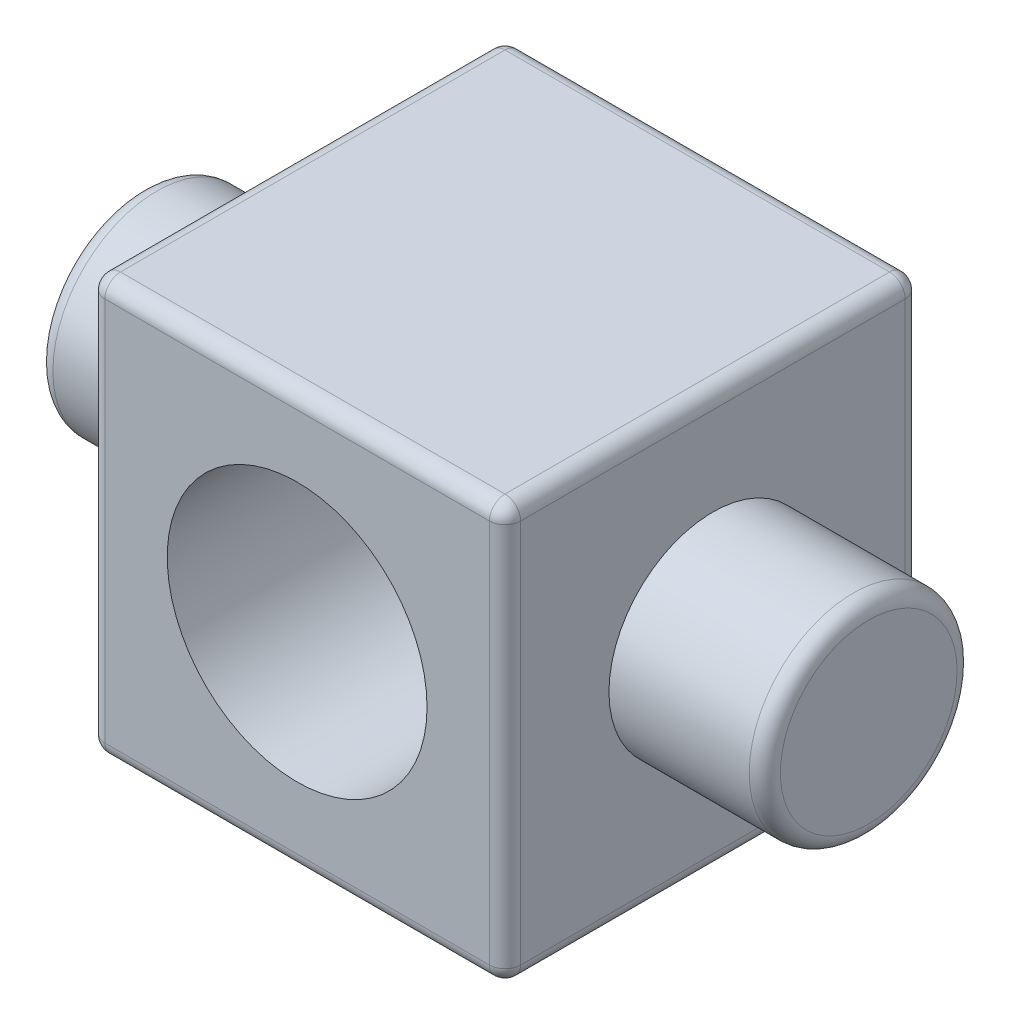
ISO-10303-21;
HEADER;
FILE_DESCRIPTION(('STEP AP214'),'2;1');
FILE_NAME('part.step','',(''),(''),'','','');
FILE_SCHEMA(('AUTOMOTIVE_DESIGN { 1 0 10303 214 1 1 1 1 }'));
ENDSEC;
DATA;
#1=APPLICATION_CONTEXT('core data for automotive mechanical design processes');
#2=APPLICATION_PROTOCOL_DEFINITION('international standard','automotive_design',2000,#1);
#3=PRODUCT_CONTEXT('',#1,'mechanical');
#4=PRODUCT('Part','Part','',(#3));
#5=PRODUCT_RELATED_PRODUCT_CATEGORY('part','',(#4));
#6=PRODUCT_DEFINITION_FORMATION('','',#4);
#7=PRODUCT_DEFINITION_CONTEXT('part definition',#1,'design');
#8=PRODUCT_DEFINITION('design','',#6,#7);
#9=PRODUCT_DEFINITION_SHAPE('','',#8);
#10=(LENGTH_UNIT() NAMED_UNIT(*) SI_UNIT(.MILLI.,.METRE.));
#11=(NAMED_UNIT(*) PLANE_ANGLE_UNIT() SI_UNIT($,.RADIAN.));
#12=(NAMED_UNIT(*) SI_UNIT($,.STERADIAN.) SOLID_ANGLE_UNIT());
#13=UNCERTAINTY_MEASURE_WITH_UNIT(LENGTH_MEASURE(1.E-05),#10,'distance_accuracy_value','');
#14=(GEOMETRIC_REPRESENTATION_CONTEXT(3) GLOBAL_UNCERTAINTY_ASSIGNED_CONTEXT((#13)) GLOBAL_UNIT_ASSIGNED_CONTEXT((#10,
#11,#12)) REPRESENTATION_CONTEXT('',''));
#15=CARTESIAN_POINT('',(0.,0.,0.));
#16=DIRECTION('',(0.,0.,1.));
#17=DIRECTION('',(1.,0.,0.));
#18=AXIS2_PLACEMENT_3D('',#15,#16,#17);
#19=CARTESIAN_POINT('',(0.,0.,80.));
#20=DIRECTION('',(0.,0.,-1.));
#21=DIRECTION('',(-1.,0.,0.));
#22=AXIS2_PLACEMENT_3D('',#19,#20,#21);
#23=PLANE('',#22);
#24=DIRECTION('',(0.,-1.,0.));
#25=VECTOR('',#24,1.);
#26=CARTESIAN_POINT('',(3.,0.,80.));
#27=LINE('',#26,#25);
#28=CARTESIAN_POINT('',(3.,77.,80.));
#29=VERTEX_POINT('',#28);
#30=CARTESIAN_POINT('',(3.,3.,80.));
#31=VERTEX_POINT('',#30);
#32=EDGE_CURVE('E189',#29,#31,#27,.T.);
#33=ORIENTED_EDGE('',*,*,#32,.T.);
#34=DIRECTION('',(1.,0.,0.));
#35=VECTOR('',#34,1.);
#36=CARTESIAN_POINT('',(0.,3.,80.));
#37=LINE('',#36,#35);
#38=CARTESIAN_POINT('',(77.,3.,80.));
#39=VERTEX_POINT('',#38);
#40=EDGE_CURVE('E191',#31,#39,#37,.T.);
#41=ORIENTED_EDGE('',*,*,#40,.T.);
#42=DIRECTION('',(0.,1.,0.));
#43=VECTOR('',#42,1.);
#44=CARTESIAN_POINT('',(77.,0.,80.));
#45=LINE('',#44,#43);
#46=CARTESIAN_POINT('',(77.,77.,80.));
#47=VERTEX_POINT('',#46);
#48=EDGE_CURVE('E185',#39,#47,#45,.T.);
#49=ORIENTED_EDGE('',*,*,#48,.T.);
#50=DIRECTION('',(-1.,0.,0.));
#51=VECTOR('',#50,1.);
#52=CARTESIAN_POINT('',(0.,77.,80.));
#53=LINE('',#52,#51);
#54=EDGE_CURVE('E187',#47,#29,#53,.T.);
#55=ORIENTED_EDGE('',*,*,#54,.T.);
#56=EDGE_LOOP('',(#33,#41,#49,#55));
#57=FACE_BOUND('',#56,.T.);
#58=CARTESIAN_POINT('',(40.,40.,80.));
#59=DIRECTION('',(0.,0.,1.));
#60=DIRECTION('',(1.,0.,0.));
#61=AXIS2_PLACEMENT_3D('',#58,#59,#60);
#62=CIRCLE('',#61,25.);
#63=CARTESIAN_POINT('',(65.,40.,80.));
#64=VERTEX_POINT('',#63);
#65=EDGE_CURVE('E270',#64,#64,#62,.T.);
#66=ORIENTED_EDGE('',*,*,#65,.F.);
#67=EDGE_LOOP('',(#66));
#68=FACE_BOUND('',#67,.T.);
#69=ADVANCED_FACE('F33',(#57,#68),#23,.F.);
#70=CARTESIAN_POINT('',(0.,0.,0.));
#71=DIRECTION('',(0.,0.,-1.));
#72=DIRECTION('',(-1.,0.,0.));
#73=AXIS2_PLACEMENT_3D('',#70,#71,#72);
#74=PLANE('',#73);
#75=DIRECTION('',(1.,0.,0.));
#76=VECTOR('',#75,1.);
#77=CARTESIAN_POINT('',(0.,3.,0.));
#78=LINE('',#77,#76);
#79=CARTESIAN_POINT('',(77.,3.,0.));
#80=VERTEX_POINT('',#79);
#81=CARTESIAN_POINT('',(3.,3.,0.));
#82=VERTEX_POINT('',#81);
#83=EDGE_CURVE('E42',#80,#82,#78,.F.);
#84=ORIENTED_EDGE('',*,*,#83,.T.);
#85=DIRECTION('',(0.,-1.,0.));
#86=VECTOR('',#85,1.);
#87=CARTESIAN_POINT('',(3.,80.,0.));
#88=LINE('',#87,#86);
#89=CARTESIAN_POINT('',(3.,77.,0.));
#90=VERTEX_POINT('',#89);
#91=EDGE_CURVE('E11',#82,#90,#88,.F.);
#92=ORIENTED_EDGE('',*,*,#91,.T.);
#93=DIRECTION('',(-1.,0.,0.));
#94=VECTOR('',#93,1.);
#95=CARTESIAN_POINT('',(80.,77.,0.));
#96=LINE('',#95,#94);
#97=CARTESIAN_POINT('',(77.,77.,0.));
#98=VERTEX_POINT('',#97);
#99=EDGE_CURVE('E203',#90,#98,#96,.F.);
#100=ORIENTED_EDGE('',*,*,#99,.T.);
#101=DIRECTION('',(0.,1.,0.));
#102=VECTOR('',#101,1.);
#103=CARTESIAN_POINT('',(77.,0.,0.));
#104=LINE('',#103,#102);
#105=EDGE_CURVE('E53',#98,#80,#104,.F.);
#106=ORIENTED_EDGE('',*,*,#105,.T.);
#107=EDGE_LOOP('',(#84,#92,#100,#106));
#108=FACE_BOUND('',#107,.T.);
#109=CARTESIAN_POINT('',(40.,40.,0.));
#110=DIRECTION('',(0.,0.,1.));
#111=DIRECTION('',(1.,0.,0.));
#112=AXIS2_PLACEMENT_3D('',#109,#110,#111);
#113=CIRCLE('',#112,25.);
#114=CARTESIAN_POINT('',(65.,40.,0.));
#115=VERTEX_POINT('',#114);
#116=EDGE_CURVE('E263',#115,#115,#113,.T.);
#117=ORIENTED_EDGE('',*,*,#116,.T.);
#118=EDGE_LOOP('',(#117));
#119=FACE_BOUND('',#118,.T.);
#120=ADVANCED_FACE('F308',(#108,#119),#74,.T.);
#121=CARTESIAN_POINT('',(0.,0.,80.));
#122=DIRECTION('',(1.,0.,0.));
#123=DIRECTION('',(0.,0.,-1.));
#124=AXIS2_PLACEMENT_3D('',#121,#122,#123);
#125=PLANE('',#124);
#126=DIRECTION('',(0.,0.,-1.));
#127=VECTOR('',#126,1.);
#128=CARTESIAN_POINT('',(0.,3.,80.));
#129=LINE('',#128,#127);
#130=CARTESIAN_POINT('',(0.,3.,3.));
#131=VERTEX_POINT('',#130);
#132=CARTESIAN_POINT('',(0.,3.,77.));
#133=VERTEX_POINT('',#132);
#134=EDGE_CURVE('E151',#131,#133,#129,.F.);
#135=ORIENTED_EDGE('',*,*,#134,.T.);
#136=DIRECTION('',(0.,-1.,0.));
#137=VECTOR('',#136,1.);
#138=CARTESIAN_POINT('',(0.,0.,77.));
#139=LINE('',#138,#137);
#140=CARTESIAN_POINT('',(0.,77.,77.));
#141=VERTEX_POINT('',#140);
#142=EDGE_CURVE('E157',#133,#141,#139,.F.);
#143=ORIENTED_EDGE('',*,*,#142,.T.);
#144=DIRECTION('',(0.,0.,-1.));
#145=VECTOR('',#144,1.);
#146=CARTESIAN_POINT('',(0.,77.,80.));
#147=LINE('',#146,#145);
#148=CARTESIAN_POINT('',(0.,77.,3.));
#149=VERTEX_POINT('',#148);
#150=EDGE_CURVE('E127',#141,#149,#147,.T.);
#151=ORIENTED_EDGE('',*,*,#150,.T.);
#152=DIRECTION('',(0.,-1.,0.));
#153=VECTOR('',#152,1.);
#154=CARTESIAN_POINT('',(0.,0.,3.));
#155=LINE('',#154,#153);
#156=EDGE_CURVE('E145',#149,#131,#155,.T.);
#157=ORIENTED_EDGE('',*,*,#156,.T.);
#158=EDGE_LOOP('',(#135,#143,#151,#157));
#159=FACE_BOUND('',#158,.T.);
#160=CARTESIAN_POINT('',(0.,40.,40.));
#161=DIRECTION('',(1.,0.,0.));
#162=DIRECTION('',(0.,0.,-1.));
#163=AXIS2_PLACEMENT_3D('',#160,#161,#162);
#164=CIRCLE('',#163,20.);
#165=CARTESIAN_POINT('',(0.,40.,20.));
#166=VERTEX_POINT('',#165);
#167=EDGE_CURVE('E280',#166,#166,#164,.F.);
#168=ORIENTED_EDGE('',*,*,#167,.F.);
#169=EDGE_LOOP('',(#168));
#170=FACE_BOUND('',#169,.T.);
#171=ADVANCED_FACE('F154',(#159,#170),#125,.F.);
#172=CARTESIAN_POINT('',(0.,0.,80.));
#173=DIRECTION('',(0.,1.,0.));
#174=DIRECTION('',(0.,0.,1.));
#175=AXIS2_PLACEMENT_3D('',#172,#173,#174);
#176=PLANE('',#175);
#177=DIRECTION('',(1.,0.,0.));
#178=VECTOR('',#177,1.);
#179=CARTESIAN_POINT('',(0.,0.,77.));
#180=LINE('',#179,#178);
#181=CARTESIAN_POINT('',(77.,0.,77.));
#182=VERTEX_POINT('',#181);
#183=CARTESIAN_POINT('',(3.,0.,77.));
#184=VERTEX_POINT('',#183);
#185=EDGE_CURVE('E180',#182,#184,#180,.F.);
#186=ORIENTED_EDGE('',*,*,#185,.T.);
#187=DIRECTION('',(0.,0.,-1.));
#188=VECTOR('',#187,1.);
#189=CARTESIAN_POINT('',(3.,0.,80.));
#190=LINE('',#189,#188);
#191=CARTESIAN_POINT('',(3.,0.,3.));
#192=VERTEX_POINT('',#191);
#193=EDGE_CURVE('E182',#184,#192,#190,.T.);
#194=ORIENTED_EDGE('',*,*,#193,.T.);
#195=DIRECTION('',(1.,0.,0.));
#196=VECTOR('',#195,1.);
#197=CARTESIAN_POINT('',(80.,0.,3.));
#198=LINE('',#197,#196);
#199=CARTESIAN_POINT('',(77.,0.,3.));
#200=VERTEX_POINT('',#199);
#201=EDGE_CURVE('E176',#192,#200,#198,.T.);
#202=ORIENTED_EDGE('',*,*,#201,.T.);
#203=DIRECTION('',(0.,0.,-1.));
#204=VECTOR('',#203,1.);
#205=CARTESIAN_POINT('',(77.,0.,80.));
#206=LINE('',#205,#204);
#207=EDGE_CURVE('E178',#200,#182,#206,.F.);
#208=ORIENTED_EDGE('',*,*,#207,.T.);
#209=EDGE_LOOP('',(#186,#194,#202,#208));
#210=FACE_BOUND('',#209,.T.);
#211=ADVANCED_FACE('F327',(#210),#176,.F.);
#212=CARTESIAN_POINT('',(80.,0.,80.));
#213=DIRECTION('',(-1.,0.,0.));
#214=DIRECTION('',(0.,0.,1.));
#215=AXIS2_PLACEMENT_3D('',#212,#213,#214);
#216=PLANE('',#215);
#217=DIRECTION('',(0.,0.,-1.));
#218=VECTOR('',#217,1.);
#219=CARTESIAN_POINT('',(80.,77.,80.));
#220=LINE('',#219,#218);
#221=CARTESIAN_POINT('',(80.,77.,3.));
#222=VERTEX_POINT('',#221);
#223=CARTESIAN_POINT('',(80.,77.,77.));
#224=VERTEX_POINT('',#223);
#225=EDGE_CURVE('E194',#222,#224,#220,.F.);
#226=ORIENTED_EDGE('',*,*,#225,.T.);
#227=DIRECTION('',(0.,1.,0.));
#228=VECTOR('',#227,1.);
#229=CARTESIAN_POINT('',(80.,0.,77.));
#230=LINE('',#229,#228);
#231=CARTESIAN_POINT('',(80.,3.,77.));
#232=VERTEX_POINT('',#231);
#233=EDGE_CURVE('E200',#224,#232,#230,.F.);
#234=ORIENTED_EDGE('',*,*,#233,.T.);
#235=DIRECTION('',(0.,0.,-1.));
#236=VECTOR('',#235,1.);
#237=CARTESIAN_POINT('',(80.,3.,80.));
#238=LINE('',#237,#236);
#239=CARTESIAN_POINT('',(80.,3.,3.));
#240=VERTEX_POINT('',#239);
#241=EDGE_CURVE('E198',#232,#240,#238,.T.);
#242=ORIENTED_EDGE('',*,*,#241,.T.);
#243=DIRECTION('',(0.,1.,0.));
#244=VECTOR('',#243,1.);
#245=CARTESIAN_POINT('',(80.,80.,3.));
#246=LINE('',#245,#244);
#247=EDGE_CURVE('E196',#240,#222,#246,.T.);
#248=ORIENTED_EDGE('',*,*,#247,.T.);
#249=EDGE_LOOP('',(#226,#234,#242,#248));
#250=FACE_BOUND('',#249,.T.);
#251=CARTESIAN_POINT('',(80.,40.,40.));
#252=DIRECTION('',(-1.,0.,0.));
#253=DIRECTION('',(0.,0.,1.));
#254=AXIS2_PLACEMENT_3D('',#251,#252,#253);
#255=CIRCLE('',#254,20.);
#256=CARTESIAN_POINT('',(80.,40.,60.));
#257=VERTEX_POINT('',#256);
#258=EDGE_CURVE('E275',#257,#257,#255,.F.);
#259=ORIENTED_EDGE('',*,*,#258,.F.);
#260=EDGE_LOOP('',(#259));
#261=FACE_BOUND('',#260,.T.);
#262=ADVANCED_FACE('F323',(#250,#261),#216,.F.);
#263=CARTESIAN_POINT('',(0.,80.,80.));
#264=DIRECTION('',(0.,-1.,0.));
#265=DIRECTION('',(0.,0.,-1.));
#266=AXIS2_PLACEMENT_3D('',#263,#264,#265);
#267=PLANE('',#266);
#268=DIRECTION('',(-1.,0.,0.));
#269=VECTOR('',#268,1.);
#270=CARTESIAN_POINT('',(0.,80.,3.));
#271=LINE('',#270,#269);
#272=CARTESIAN_POINT('',(77.,80.,3.));
#273=VERTEX_POINT('',#272);
#274=CARTESIAN_POINT('',(3.,80.,3.));
#275=VERTEX_POINT('',#274);
#276=EDGE_CURVE('E160',#273,#275,#271,.T.);
#277=ORIENTED_EDGE('',*,*,#276,.T.);
#278=DIRECTION('',(0.,0.,-1.));
#279=VECTOR('',#278,1.);
#280=CARTESIAN_POINT('',(3.,80.,80.));
#281=LINE('',#280,#279);
#282=CARTESIAN_POINT('',(3.,80.,77.));
#283=VERTEX_POINT('',#282);
#284=EDGE_CURVE('E129',#275,#283,#281,.F.);
#285=ORIENTED_EDGE('',*,*,#284,.T.);
#286=DIRECTION('',(-1.,0.,0.));
#287=VECTOR('',#286,1.);
#288=CARTESIAN_POINT('',(0.,80.,77.));
#289=LINE('',#288,#287);
#290=CARTESIAN_POINT('',(77.,80.,77.));
#291=VERTEX_POINT('',#290);
#292=EDGE_CURVE('E167',#283,#291,#289,.F.);
#293=ORIENTED_EDGE('',*,*,#292,.T.);
#294=DIRECTION('',(0.,0.,-1.));
#295=VECTOR('',#294,1.);
#296=CARTESIAN_POINT('',(77.,80.,80.));
#297=LINE('',#296,#295);
#298=EDGE_CURVE('E165',#291,#273,#297,.T.);
#299=ORIENTED_EDGE('',*,*,#298,.T.);
#300=EDGE_LOOP('',(#277,#285,#293,#299));
#301=FACE_BOUND('',#300,.T.);
#302=ADVANCED_FACE('F320',(#301),#267,.F.);
#303=CARTESIAN_POINT('',(40.,40.,80.));
#304=DIRECTION('',(0.,0.,-1.));
#305=DIRECTION('',(-1.,0.,0.));
#306=AXIS2_PLACEMENT_3D('',#303,#304,#305);
#307=CYLINDRICAL_SURFACE('',#306,25.);
#308=ORIENTED_EDGE('',*,*,#65,.T.);
#309=EDGE_LOOP('',(#308));
#310=FACE_BOUND('',#309,.T.);
#311=ORIENTED_EDGE('',*,*,#116,.F.);
#312=EDGE_LOOP('',(#311));
#313=FACE_BOUND('',#312,.T.);
#314=ADVANCED_FACE('F317',(#310,#313),#307,.F.);
#315=CARTESIAN_POINT('',(110.,40.,40.));
#316=DIRECTION('',(-1.,0.,0.));
#317=DIRECTION('',(0.,0.,1.));
#318=AXIS2_PLACEMENT_3D('',#315,#316,#317);
#319=CYLINDRICAL_SURFACE('',#318,20.);
#320=CARTESIAN_POINT('',(107.,40.,40.));
#321=DIRECTION('',(1.,0.,0.));
#322=DIRECTION('',(0.,0.,-1.));
#323=AXIS2_PLACEMENT_3D('',#320,#321,#322);
#324=CIRCLE('',#323,20.);
#325=CARTESIAN_POINT('',(107.,40.,20.));
#326=VERTEX_POINT('',#325);
#327=EDGE_CURVE('E173',#326,#326,#324,.F.);
#328=ORIENTED_EDGE('',*,*,#327,.T.);
#329=EDGE_LOOP('',(#328));
#330=FACE_BOUND('',#329,.T.);
#331=ORIENTED_EDGE('',*,*,#258,.T.);
#332=EDGE_LOOP('',(#331));
#333=FACE_BOUND('',#332,.T.);
#334=ADVANCED_FACE('F433',(#330,#333),#319,.T.);
#335=CARTESIAN_POINT('',(110.,40.,40.));
#336=DIRECTION('',(1.,0.,0.));
#337=DIRECTION('',(0.,0.,-1.));
#338=AXIS2_PLACEMENT_3D('',#335,#336,#337);
#339=PLANE('',#338);
#340=CARTESIAN_POINT('',(110.,40.,40.));
#341=DIRECTION('',(1.,0.,0.));
#342=DIRECTION('',(0.,0.,-1.));
#343=AXIS2_PLACEMENT_3D('',#340,#341,#342);
#344=CIRCLE('',#343,17.);
#345=CARTESIAN_POINT('',(110.,40.,23.));
#346=VERTEX_POINT('',#345);
#347=EDGE_CURVE('E170',#346,#346,#344,.T.);
#348=ORIENTED_EDGE('',*,*,#347,.T.);
#349=EDGE_LOOP('',(#348));
#350=FACE_BOUND('',#349,.T.);
#351=ADVANCED_FACE('F305',(#350),#339,.T.);
#352=CARTESIAN_POINT('',(-30.,40.,40.));
#353=DIRECTION('',(1.,0.,0.));
#354=DIRECTION('',(0.,0.,-1.));
#355=AXIS2_PLACEMENT_3D('',#352,#353,#354);
#356=CYLINDRICAL_SURFACE('',#355,20.);
#357=CARTESIAN_POINT('',(-27.,40.,40.));
#358=DIRECTION('',(-1.,0.,0.));
#359=DIRECTION('',(0.,0.,1.));
#360=AXIS2_PLACEMENT_3D('',#357,#358,#359);
#361=CIRCLE('',#360,20.);
#362=CARTESIAN_POINT('',(-27.,40.,60.));
#363=VERTEX_POINT('',#362);
#364=EDGE_CURVE('E152',#363,#363,#361,.F.);
#365=ORIENTED_EDGE('',*,*,#364,.T.);
#366=EDGE_LOOP('',(#365));
#367=FACE_BOUND('',#366,.T.);
#368=ORIENTED_EDGE('',*,*,#167,.T.);
#369=EDGE_LOOP('',(#368));
#370=FACE_BOUND('',#369,.T.);
#371=ADVANCED_FACE('F289',(#367,#370),#356,.T.);
#372=CARTESIAN_POINT('',(-30.,40.,40.));
#373=DIRECTION('',(-1.,0.,0.));
#374=DIRECTION('',(0.,0.,1.));
#375=AXIS2_PLACEMENT_3D('',#372,#373,#374);
#376=PLANE('',#375);
#377=CARTESIAN_POINT('',(-30.,40.,40.));
#378=DIRECTION('',(-1.,0.,0.));
#379=DIRECTION('',(0.,0.,1.));
#380=AXIS2_PLACEMENT_3D('',#377,#378,#379);
#381=CIRCLE('',#380,17.);
#382=CARTESIAN_POINT('',(-30.,40.,57.));
#383=VERTEX_POINT('',#382);
#384=EDGE_CURVE('E283',#383,#383,#381,.T.);
#385=ORIENTED_EDGE('',*,*,#384,.T.);
#386=EDGE_LOOP('',(#385));
#387=FACE_BOUND('',#386,.T.);
#388=ADVANCED_FACE('F296',(#387),#376,.T.);
#389=CARTESIAN_POINT('',(-27.,40.,40.));
#390=DIRECTION('',(-1.,0.,0.));
#391=DIRECTION('',(0.,0.,1.));
#392=AXIS2_PLACEMENT_3D('',#389,#390,#391);
#393=TOROIDAL_SURFACE('',#392,17.,3.);
#394=ORIENTED_EDGE('',*,*,#364,.F.);
#395=EDGE_LOOP('',(#394));
#396=FACE_BOUND('',#395,.T.);
#397=ORIENTED_EDGE('',*,*,#384,.F.);
#398=EDGE_LOOP('',(#397));
#399=FACE_BOUND('',#398,.T.);
#400=ADVANCED_FACE('F292',(#396,#399),#393,.T.);
#401=CARTESIAN_POINT('',(77.,3.,80.));
#402=DIRECTION('',(0.,0.,-1.));
#403=DIRECTION('',(-1.,0.,0.));
#404=AXIS2_PLACEMENT_3D('',#401,#402,#403);
#405=CYLINDRICAL_SURFACE('',#404,3.);
#406=CARTESIAN_POINT('',(77.,3.,77.));
#407=DIRECTION('',(0.,0.,1.));
#408=DIRECTION('',(1.,0.,0.));
#409=AXIS2_PLACEMENT_3D('',#406,#407,#408);
#410=CIRCLE('',#409,3.);
#411=EDGE_CURVE('E37',#182,#232,#410,.T.);
#412=ORIENTED_EDGE('',*,*,#411,.F.);
#413=ORIENTED_EDGE('',*,*,#207,.F.);
#414=CARTESIAN_POINT('',(77.,3.,3.));
#415=DIRECTION('',(0.,0.,-1.));
#416=DIRECTION('',(-1.,0.,0.));
#417=AXIS2_PLACEMENT_3D('',#414,#415,#416);
#418=CIRCLE('',#417,3.);
#419=EDGE_CURVE('E256',#240,#200,#418,.T.);
#420=ORIENTED_EDGE('',*,*,#419,.F.);
#421=ORIENTED_EDGE('',*,*,#241,.F.);
#422=EDGE_LOOP('',(#412,#413,#420,#421));
#423=FACE_BOUND('',#422,.T.);
#424=ADVANCED_FACE('F295',(#423),#405,.T.);
#425=CARTESIAN_POINT('',(77.,3.,77.));
#426=DIRECTION('',(0.,0.,1.));
#427=DIRECTION('',(1.,0.,0.));
#428=AXIS2_PLACEMENT_3D('',#425,#426,#427);
#429=SPHERICAL_SURFACE('',#428,3.);
#430=CARTESIAN_POINT('',(77.,3.,77.));
#431=DIRECTION('',(1.,0.,0.));
#432=DIRECTION('',(0.,0.,-1.));
#433=AXIS2_PLACEMENT_3D('',#430,#431,#432);
#434=CIRCLE('',#433,3.);
#435=EDGE_CURVE('E252',#182,#39,#434,.F.);
#436=ORIENTED_EDGE('',*,*,#435,.F.);
#437=ORIENTED_EDGE('',*,*,#411,.T.);
#438=CARTESIAN_POINT('',(77.,3.,77.));
#439=DIRECTION('',(0.,-1.,0.));
#440=DIRECTION('',(0.,0.,-1.));
#441=AXIS2_PLACEMENT_3D('',#438,#439,#440);
#442=CIRCLE('',#441,3.);
#443=EDGE_CURVE('E255',#39,#232,#442,.F.);
#444=ORIENTED_EDGE('',*,*,#443,.F.);
#445=EDGE_LOOP('',(#436,#437,#444));
#446=FACE_BOUND('',#445,.T.);
#447=ADVANCED_FACE('F399',(#446),#429,.T.);
#448=CARTESIAN_POINT('',(77.,3.,3.));
#449=DIRECTION('',(0.,0.,1.));
#450=DIRECTION('',(1.,0.,0.));
#451=AXIS2_PLACEMENT_3D('',#448,#449,#450);
#452=SPHERICAL_SURFACE('',#451,3.);
#453=CARTESIAN_POINT('',(77.,3.,3.));
#454=DIRECTION('',(0.,-1.,0.));
#455=DIRECTION('',(0.,0.,-1.));
#456=AXIS2_PLACEMENT_3D('',#453,#454,#455);
#457=CIRCLE('',#456,3.);
#458=EDGE_CURVE('E247',#240,#80,#457,.F.);
#459=ORIENTED_EDGE('',*,*,#458,.F.);
#460=ORIENTED_EDGE('',*,*,#419,.T.);
#461=CARTESIAN_POINT('',(77.,3.,3.));
#462=DIRECTION('',(1.,0.,0.));
#463=DIRECTION('',(0.,0.,-1.));
#464=AXIS2_PLACEMENT_3D('',#461,#462,#463);
#465=CIRCLE('',#464,3.);
#466=EDGE_CURVE('E249',#80,#200,#465,.F.);
#467=ORIENTED_EDGE('',*,*,#466,.F.);
#468=EDGE_LOOP('',(#459,#460,#467));
#469=FACE_BOUND('',#468,.T.);
#470=ADVANCED_FACE('F395',(#469),#452,.T.);
#471=CARTESIAN_POINT('',(77.,0.,77.));
#472=DIRECTION('',(0.,1.,0.));
#473=DIRECTION('',(0.,0.,1.));
#474=AXIS2_PLACEMENT_3D('',#471,#472,#473);
#475=CYLINDRICAL_SURFACE('',#474,3.);
#476=ORIENTED_EDGE('',*,*,#443,.T.);
#477=ORIENTED_EDGE('',*,*,#233,.F.);
#478=CARTESIAN_POINT('',(77.,77.,77.));
#479=DIRECTION('',(0.,1.,0.));
#480=DIRECTION('',(0.,0.,1.));
#481=AXIS2_PLACEMENT_3D('',#478,#479,#480);
#482=CIRCLE('',#481,3.);
#483=EDGE_CURVE('E241',#47,#224,#482,.T.);
#484=ORIENTED_EDGE('',*,*,#483,.F.);
#485=ORIENTED_EDGE('',*,*,#48,.F.);
#486=EDGE_LOOP('',(#476,#477,#484,#485));
#487=FACE_BOUND('',#486,.T.);
#488=ADVANCED_FACE('F391',(#487),#475,.T.);
#489=CARTESIAN_POINT('',(0.,3.,77.));
#490=DIRECTION('',(1.,0.,0.));
#491=DIRECTION('',(0.,0.,-1.));
#492=AXIS2_PLACEMENT_3D('',#489,#490,#491);
#493=CYLINDRICAL_SURFACE('',#492,3.);
#494=ORIENTED_EDGE('',*,*,#435,.T.);
#495=ORIENTED_EDGE('',*,*,#40,.F.);
#496=CARTESIAN_POINT('',(3.,3.,77.));
#497=DIRECTION('',(-1.,0.,0.));
#498=DIRECTION('',(0.,0.,1.));
#499=AXIS2_PLACEMENT_3D('',#496,#497,#498);
#500=CIRCLE('',#499,3.);
#501=EDGE_CURVE('E238',#184,#31,#500,.T.);
#502=ORIENTED_EDGE('',*,*,#501,.F.);
#503=ORIENTED_EDGE('',*,*,#185,.F.);
#504=EDGE_LOOP('',(#494,#495,#502,#503));
#505=FACE_BOUND('',#504,.T.);
#506=ADVANCED_FACE('F387',(#505),#493,.T.);
#507=CARTESIAN_POINT('',(3.,3.,80.));
#508=DIRECTION('',(0.,0.,-1.));
#509=DIRECTION('',(-1.,0.,0.));
#510=AXIS2_PLACEMENT_3D('',#507,#508,#509);
#511=CYLINDRICAL_SURFACE('',#510,3.);
#512=CARTESIAN_POINT('',(3.,3.,3.));
#513=DIRECTION('',(0.,0.,-1.));
#514=DIRECTION('',(-1.,0.,0.));
#515=AXIS2_PLACEMENT_3D('',#512,#513,#514);
#516=CIRCLE('',#515,3.);
#517=EDGE_CURVE('E232',#192,#131,#516,.T.);
#518=ORIENTED_EDGE('',*,*,#517,.F.);
#519=ORIENTED_EDGE('',*,*,#193,.F.);
#520=CARTESIAN_POINT('',(3.,3.,77.));
#521=DIRECTION('',(0.,0.,1.));
#522=DIRECTION('',(1.,0.,0.));
#523=AXIS2_PLACEMENT_3D('',#520,#521,#522);
#524=CIRCLE('',#523,3.);
#525=EDGE_CURVE('E235',#133,#184,#524,.T.);
#526=ORIENTED_EDGE('',*,*,#525,.F.);
#527=ORIENTED_EDGE('',*,*,#134,.F.);
#528=EDGE_LOOP('',(#518,#519,#526,#527));
#529=FACE_BOUND('',#528,.T.);
#530=ADVANCED_FACE('F383',(#529),#511,.T.);
#531=CARTESIAN_POINT('',(0.,3.,3.));
#532=DIRECTION('',(-1.,0.,0.));
#533=DIRECTION('',(0.,0.,1.));
#534=AXIS2_PLACEMENT_3D('',#531,#532,#533);
#535=CYLINDRICAL_SURFACE('',#534,3.);
#536=ORIENTED_EDGE('',*,*,#466,.T.);
#537=ORIENTED_EDGE('',*,*,#201,.F.);
#538=CARTESIAN_POINT('',(3.,3.,3.));
#539=DIRECTION('',(-1.,0.,0.));
#540=DIRECTION('',(0.,0.,1.));
#541=AXIS2_PLACEMENT_3D('',#538,#539,#540);
#542=CIRCLE('',#541,3.);
#543=EDGE_CURVE('E230',#82,#192,#542,.T.);
#544=ORIENTED_EDGE('',*,*,#543,.F.);
#545=ORIENTED_EDGE('',*,*,#83,.F.);
#546=EDGE_LOOP('',(#536,#537,#544,#545));
#547=FACE_BOUND('',#546,.T.);
#548=ADVANCED_FACE('F379',(#547),#535,.T.);
#549=CARTESIAN_POINT('',(77.,0.,3.));
#550=DIRECTION('',(0.,-1.,0.));
#551=DIRECTION('',(0.,0.,-1.));
#552=AXIS2_PLACEMENT_3D('',#549,#550,#551);
#553=CYLINDRICAL_SURFACE('',#552,3.);
#554=ORIENTED_EDGE('',*,*,#458,.T.);
#555=ORIENTED_EDGE('',*,*,#105,.F.);
#556=CARTESIAN_POINT('',(77.,77.,3.));
#557=DIRECTION('',(0.,1.,0.));
#558=DIRECTION('',(0.,0.,1.));
#559=AXIS2_PLACEMENT_3D('',#556,#557,#558);
#560=CIRCLE('',#559,3.);
#561=EDGE_CURVE('E227',#222,#98,#560,.T.);
#562=ORIENTED_EDGE('',*,*,#561,.F.);
#563=ORIENTED_EDGE('',*,*,#247,.F.);
#564=EDGE_LOOP('',(#554,#555,#562,#563));
#565=FACE_BOUND('',#564,.T.);
#566=ADVANCED_FACE('F375',(#565),#553,.T.);
#567=CARTESIAN_POINT('',(77.,77.,80.));
#568=DIRECTION('',(0.,0.,-1.));
#569=DIRECTION('',(-1.,0.,0.));
#570=AXIS2_PLACEMENT_3D('',#567,#568,#569);
#571=CYLINDRICAL_SURFACE('',#570,3.);
#572=CARTESIAN_POINT('',(77.,77.,77.));
#573=DIRECTION('',(0.,0.,1.));
#574=DIRECTION('',(1.,0.,0.));
#575=AXIS2_PLACEMENT_3D('',#572,#573,#574);
#576=CIRCLE('',#575,3.);
#577=EDGE_CURVE('E244',#224,#291,#576,.T.);
#578=ORIENTED_EDGE('',*,*,#577,.F.);
#579=ORIENTED_EDGE('',*,*,#225,.F.);
#580=CARTESIAN_POINT('',(77.,77.,3.));
#581=DIRECTION('',(0.,0.,-1.));
#582=DIRECTION('',(-1.,0.,0.));
#583=AXIS2_PLACEMENT_3D('',#580,#581,#582);
#584=CIRCLE('',#583,3.);
#585=EDGE_CURVE('E224',#273,#222,#584,.T.);
#586=ORIENTED_EDGE('',*,*,#585,.F.);
#587=ORIENTED_EDGE('',*,*,#298,.F.);
#588=EDGE_LOOP('',(#578,#579,#586,#587));
#589=FACE_BOUND('',#588,.T.);
#590=ADVANCED_FACE('F371',(#589),#571,.T.);
#591=CARTESIAN_POINT('',(77.,77.,77.));
#592=DIRECTION('',(0.,0.,1.));
#593=DIRECTION('',(1.,0.,0.));
#594=AXIS2_PLACEMENT_3D('',#591,#592,#593);
#595=SPHERICAL_SURFACE('',#594,3.);
#596=ORIENTED_EDGE('',*,*,#483,.T.);
#597=ORIENTED_EDGE('',*,*,#577,.T.);
#598=CARTESIAN_POINT('',(77.,77.,77.));
#599=DIRECTION('',(1.,0.,0.));
#600=DIRECTION('',(0.,0.,-1.));
#601=AXIS2_PLACEMENT_3D('',#598,#599,#600);
#602=CIRCLE('',#601,3.);
#603=EDGE_CURVE('E221',#47,#291,#602,.F.);
#604=ORIENTED_EDGE('',*,*,#603,.F.);
#605=EDGE_LOOP('',(#596,#597,#604));
#606=FACE_BOUND('',#605,.T.);
#607=ADVANCED_FACE('F367',(#606),#595,.T.);
#608=CARTESIAN_POINT('',(3.,3.,77.));
#609=DIRECTION('',(0.,0.,1.));
#610=DIRECTION('',(1.,0.,0.));
#611=AXIS2_PLACEMENT_3D('',#608,#609,#610);
#612=SPHERICAL_SURFACE('',#611,3.);
#613=ORIENTED_EDGE('',*,*,#525,.T.);
#614=ORIENTED_EDGE('',*,*,#501,.T.);
#615=CARTESIAN_POINT('',(3.,3.,77.));
#616=DIRECTION('',(0.,-1.,0.));
#617=DIRECTION('',(0.,0.,-1.));
#618=AXIS2_PLACEMENT_3D('',#615,#616,#617);
#619=CIRCLE('',#618,3.);
#620=EDGE_CURVE('E218',#133,#31,#619,.F.);
#621=ORIENTED_EDGE('',*,*,#620,.F.);
#622=EDGE_LOOP('',(#613,#614,#621));
#623=FACE_BOUND('',#622,.T.);
#624=ADVANCED_FACE('F363',(#623),#612,.T.);
#625=CARTESIAN_POINT('',(3.,3.,3.));
#626=DIRECTION('',(0.,0.,1.));
#627=DIRECTION('',(1.,0.,0.));
#628=AXIS2_PLACEMENT_3D('',#625,#626,#627);
#629=SPHERICAL_SURFACE('',#628,3.);
#630=ORIENTED_EDGE('',*,*,#543,.T.);
#631=ORIENTED_EDGE('',*,*,#517,.T.);
#632=CARTESIAN_POINT('',(3.,3.,3.));
#633=DIRECTION('',(0.,-1.,0.));
#634=DIRECTION('',(0.,0.,-1.));
#635=AXIS2_PLACEMENT_3D('',#632,#633,#634);
#636=CIRCLE('',#635,3.);
#637=EDGE_CURVE('E148',#82,#131,#636,.F.);
#638=ORIENTED_EDGE('',*,*,#637,.F.);
#639=EDGE_LOOP('',(#630,#631,#638));
#640=FACE_BOUND('',#639,.T.);
#641=ADVANCED_FACE('F359',(#640),#629,.T.);
#642=CARTESIAN_POINT('',(77.,77.,3.));
#643=DIRECTION('',(0.,0.,1.));
#644=DIRECTION('',(1.,0.,0.));
#645=AXIS2_PLACEMENT_3D('',#642,#643,#644);
#646=SPHERICAL_SURFACE('',#645,3.);
#647=ORIENTED_EDGE('',*,*,#585,.T.);
#648=ORIENTED_EDGE('',*,*,#561,.T.);
#649=CARTESIAN_POINT('',(77.,77.,3.));
#650=DIRECTION('',(1.,0.,0.));
#651=DIRECTION('',(0.,0.,-1.));
#652=AXIS2_PLACEMENT_3D('',#649,#650,#651);
#653=CIRCLE('',#652,3.);
#654=EDGE_CURVE('E214',#273,#98,#653,.F.);
#655=ORIENTED_EDGE('',*,*,#654,.F.);
#656=EDGE_LOOP('',(#647,#648,#655));
#657=FACE_BOUND('',#656,.T.);
#658=ADVANCED_FACE('F355',(#657),#646,.T.);
#659=CARTESIAN_POINT('',(0.,77.,77.));
#660=DIRECTION('',(-1.,0.,0.));
#661=DIRECTION('',(0.,0.,1.));
#662=AXIS2_PLACEMENT_3D('',#659,#660,#661);
#663=CYLINDRICAL_SURFACE('',#662,3.);
#664=ORIENTED_EDGE('',*,*,#603,.T.);
#665=ORIENTED_EDGE('',*,*,#292,.F.);
#666=CARTESIAN_POINT('',(3.,77.,77.));
#667=DIRECTION('',(-1.,0.,0.));
#668=DIRECTION('',(0.,0.,1.));
#669=AXIS2_PLACEMENT_3D('',#666,#667,#668);
#670=CIRCLE('',#669,3.);
#671=EDGE_CURVE('E211',#29,#283,#670,.T.);
#672=ORIENTED_EDGE('',*,*,#671,.F.);
#673=ORIENTED_EDGE('',*,*,#54,.F.);
#674=EDGE_LOOP('',(#664,#665,#672,#673));
#675=FACE_BOUND('',#674,.T.);
#676=ADVANCED_FACE('F351',(#675),#663,.T.);
#677=CARTESIAN_POINT('',(3.,0.,77.));
#678=DIRECTION('',(0.,-1.,0.));
#679=DIRECTION('',(0.,0.,-1.));
#680=AXIS2_PLACEMENT_3D('',#677,#678,#679);
#681=CYLINDRICAL_SURFACE('',#680,3.);
#682=ORIENTED_EDGE('',*,*,#620,.T.);
#683=ORIENTED_EDGE('',*,*,#32,.F.);
#684=CARTESIAN_POINT('',(3.,77.,77.));
#685=DIRECTION('',(0.,1.,0.));
#686=DIRECTION('',(0.,0.,1.));
#687=AXIS2_PLACEMENT_3D('',#684,#685,#686);
#688=CIRCLE('',#687,3.);
#689=EDGE_CURVE('E142',#141,#29,#688,.T.);
#690=ORIENTED_EDGE('',*,*,#689,.F.);
#691=ORIENTED_EDGE('',*,*,#142,.F.);
#692=EDGE_LOOP('',(#682,#683,#690,#691));
#693=FACE_BOUND('',#692,.T.);
#694=ADVANCED_FACE('F348',(#693),#681,.T.);
#695=CARTESIAN_POINT('',(3.,0.,3.));
#696=DIRECTION('',(0.,1.,0.));
#697=DIRECTION('',(0.,0.,1.));
#698=AXIS2_PLACEMENT_3D('',#695,#696,#697);
#699=CYLINDRICAL_SURFACE('',#698,3.);
#700=ORIENTED_EDGE('',*,*,#637,.T.);
#701=ORIENTED_EDGE('',*,*,#156,.F.);
#702=CARTESIAN_POINT('',(3.,77.,3.));
#703=DIRECTION('',(0.,1.,0.));
#704=DIRECTION('',(0.,0.,1.));
#705=AXIS2_PLACEMENT_3D('',#702,#703,#704);
#706=CIRCLE('',#705,3.);
#707=EDGE_CURVE('E134',#90,#149,#706,.T.);
#708=ORIENTED_EDGE('',*,*,#707,.F.);
#709=ORIENTED_EDGE('',*,*,#91,.F.);
#710=EDGE_LOOP('',(#700,#701,#708,#709));
#711=FACE_BOUND('',#710,.T.);
#712=ADVANCED_FACE('F146',(#711),#699,.T.);
#713=CARTESIAN_POINT('',(0.,77.,3.));
#714=DIRECTION('',(1.,0.,0.));
#715=DIRECTION('',(0.,0.,-1.));
#716=AXIS2_PLACEMENT_3D('',#713,#714,#715);
#717=CYLINDRICAL_SURFACE('',#716,3.);
#718=ORIENTED_EDGE('',*,*,#654,.T.);
#719=ORIENTED_EDGE('',*,*,#99,.F.);
#720=CARTESIAN_POINT('',(3.,77.,3.));
#721=DIRECTION('',(-1.,0.,0.));
#722=DIRECTION('',(0.,0.,1.));
#723=AXIS2_PLACEMENT_3D('',#720,#721,#722);
#724=CIRCLE('',#723,3.);
#725=EDGE_CURVE('E138',#275,#90,#724,.T.);
#726=ORIENTED_EDGE('',*,*,#725,.F.);
#727=ORIENTED_EDGE('',*,*,#276,.F.);
#728=EDGE_LOOP('',(#718,#719,#726,#727));
#729=FACE_BOUND('',#728,.T.);
#730=ADVANCED_FACE('F341',(#729),#717,.T.);
#731=CARTESIAN_POINT('',(3.,77.,77.));
#732=DIRECTION('',(0.,0.,1.));
#733=DIRECTION('',(1.,0.,0.));
#734=AXIS2_PLACEMENT_3D('',#731,#732,#733);
#735=SPHERICAL_SURFACE('',#734,3.);
#736=ORIENTED_EDGE('',*,*,#689,.T.);
#737=ORIENTED_EDGE('',*,*,#671,.T.);
#738=CARTESIAN_POINT('',(3.,77.,77.));
#739=DIRECTION('',(0.,0.,1.));
#740=DIRECTION('',(1.,0.,0.));
#741=AXIS2_PLACEMENT_3D('',#738,#739,#740);
#742=CIRCLE('',#741,3.);
#743=EDGE_CURVE('E131',#141,#283,#742,.F.);
#744=ORIENTED_EDGE('',*,*,#743,.F.);
#745=EDGE_LOOP('',(#736,#737,#744));
#746=FACE_BOUND('',#745,.T.);
#747=ADVANCED_FACE('F338',(#746),#735,.T.);
#748=CARTESIAN_POINT('',(3.,77.,3.));
#749=DIRECTION('',(0.,0.,1.));
#750=DIRECTION('',(1.,0.,0.));
#751=AXIS2_PLACEMENT_3D('',#748,#749,#750);
#752=SPHERICAL_SURFACE('',#751,3.);
#753=ORIENTED_EDGE('',*,*,#725,.T.);
#754=ORIENTED_EDGE('',*,*,#707,.T.);
#755=CARTESIAN_POINT('',(3.,77.,3.));
#756=DIRECTION('',(0.,0.,-1.));
#757=DIRECTION('',(-1.,0.,0.));
#758=AXIS2_PLACEMENT_3D('',#755,#756,#757);
#759=CIRCLE('',#758,3.);
#760=EDGE_CURVE('E123',#275,#149,#759,.F.);
#761=ORIENTED_EDGE('',*,*,#760,.F.);
#762=EDGE_LOOP('',(#753,#754,#761));
#763=FACE_BOUND('',#762,.T.);
#764=ADVANCED_FACE('F136',(#763),#752,.T.);
#765=CARTESIAN_POINT('',(3.,77.,80.));
#766=DIRECTION('',(0.,0.,-1.));
#767=DIRECTION('',(-1.,0.,0.));
#768=AXIS2_PLACEMENT_3D('',#765,#766,#767);
#769=CYLINDRICAL_SURFACE('',#768,3.);
#770=ORIENTED_EDGE('',*,*,#743,.T.);
#771=ORIENTED_EDGE('',*,*,#284,.F.);
#772=ORIENTED_EDGE('',*,*,#760,.T.);
#773=ORIENTED_EDGE('',*,*,#150,.F.);
#774=EDGE_LOOP('',(#770,#771,#772,#773));
#775=FACE_BOUND('',#774,.T.);
#776=ADVANCED_FACE('F125',(#775),#769,.T.);
#777=CARTESIAN_POINT('',(107.,40.,40.));
#778=DIRECTION('',(1.,0.,0.));
#779=DIRECTION('',(0.,0.,-1.));
#780=AXIS2_PLACEMENT_3D('',#777,#778,#779);
#781=TOROIDAL_SURFACE('',#780,17.,3.);
#782=ORIENTED_EDGE('',*,*,#327,.F.);
#783=EDGE_LOOP('',(#782));
#784=FACE_BOUND('',#783,.T.);
#785=ORIENTED_EDGE('',*,*,#347,.F.);
#786=EDGE_LOOP('',(#785));
#787=FACE_BOUND('',#786,.T.);
#788=ADVANCED_FACE('F35',(#784,#787),#781,.T.);
#789=CLOSED_SHELL('',(#69,#120,#171,#211,#262,#302,#314,#334,#351,#371,#388,#400,#424,#447,#470,
#488,#506,#530,#548,#566,#590,#607,#624,#641,#658,#676,#694,#712,#730,#747,#764,#776,#788));
#790=MANIFOLD_SOLID_BREP('B2',#789);
#791=ADVANCED_BREP_SHAPE_REPRESENTATION('',(#18,#790),#14);
#792=SHAPE_DEFINITION_REPRESENTATION(#9,#791);
ENDSEC;
END-ISO-10303-21;
